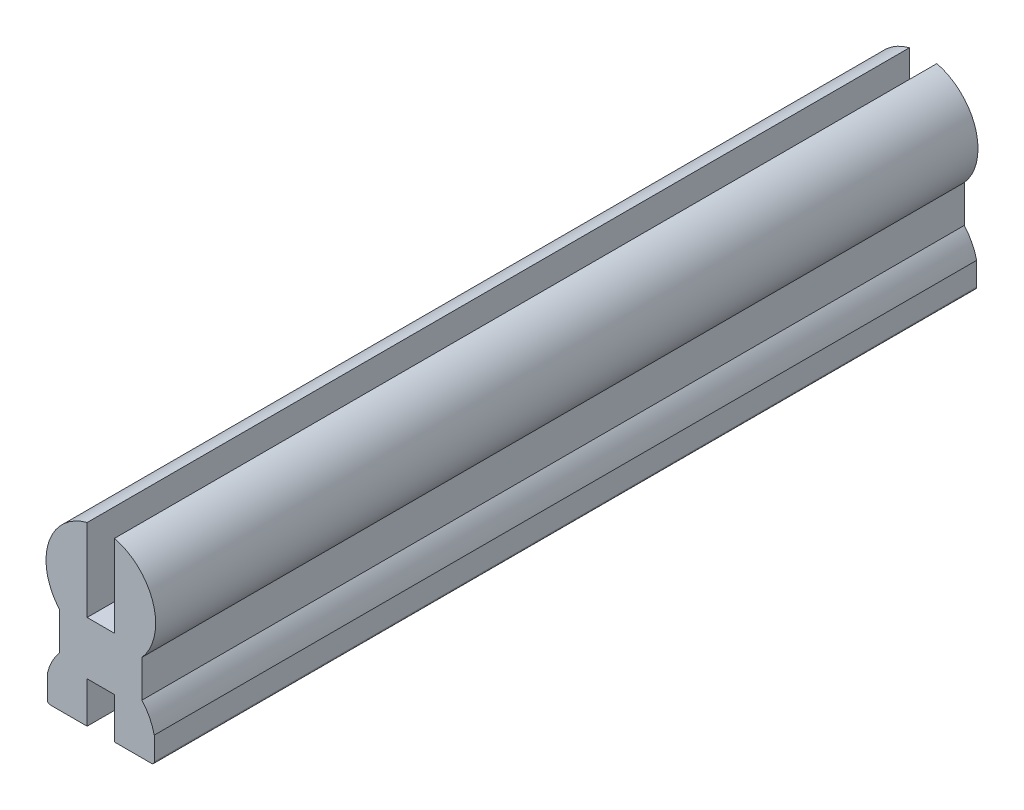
from build123d import *

# Parameters (mm, degrees)
EXTRUDE_1_DEPTH = 30
FILLET_1_R      = 0.1


with BuildPart() as part:
    # Sketch 1 → Extrude 1 (new body)
    with BuildSketch(Plane.XY):
        with BuildLine():
            Line((-1.95, -2.5), (-0.5, -2.5))
            Line((-0.5, -2.5), (-0.5, -1))
            Line((-0.5, -1), (0.5, -1))
            Line((0.5, -1), (0.5, -2.5))
            Line((0.5, -2.5), (1.95, -2.5))
            Line((1.95, -2.5), (1.95, -1.555590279))
            ThreePointArc((1.95, -1.555590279), (1.780042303, -1.088161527), (1.5, -0.677124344))
            Line((1.5, -0.677124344), (1.5, 0.677124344))
            ThreePointArc((1.5, 0.677124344), (1.912032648, 2.586626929), (0.5, 3.936491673))
            Line((0.5, 3.936491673), (0.5, 0.936491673))
            Line((0.5, 0.936491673), (-0.5, 0.936491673))
            Line((-0.5, 0.936491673), (-0.5, 3.936491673))
            ThreePointArc((-0.5, 3.936491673), (-1.912032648, 2.586626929), (-1.5, 0.677124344))
            Line((-1.5, 0.677124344), (-1.5, -0.677124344))
            ThreePointArc((-1.5, -0.677124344), (-1.780042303, -1.088161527), (-1.95, -1.555590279))
            Line((-1.95, -1.555590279), (-1.95, -2.5))
        make_face()
    extrude(amount=-EXTRUDE_1_DEPTH)

    # Fillet 1
    fillet_1_edges = [part.edges().sort_by_distance(p)[0] for p in [
        (1.95, -2.5, -15),
        (-1.95, -2.5, -15),
    ]]
    fillet(fillet_1_edges, radius=FILLET_1_R)


solid = part.part
